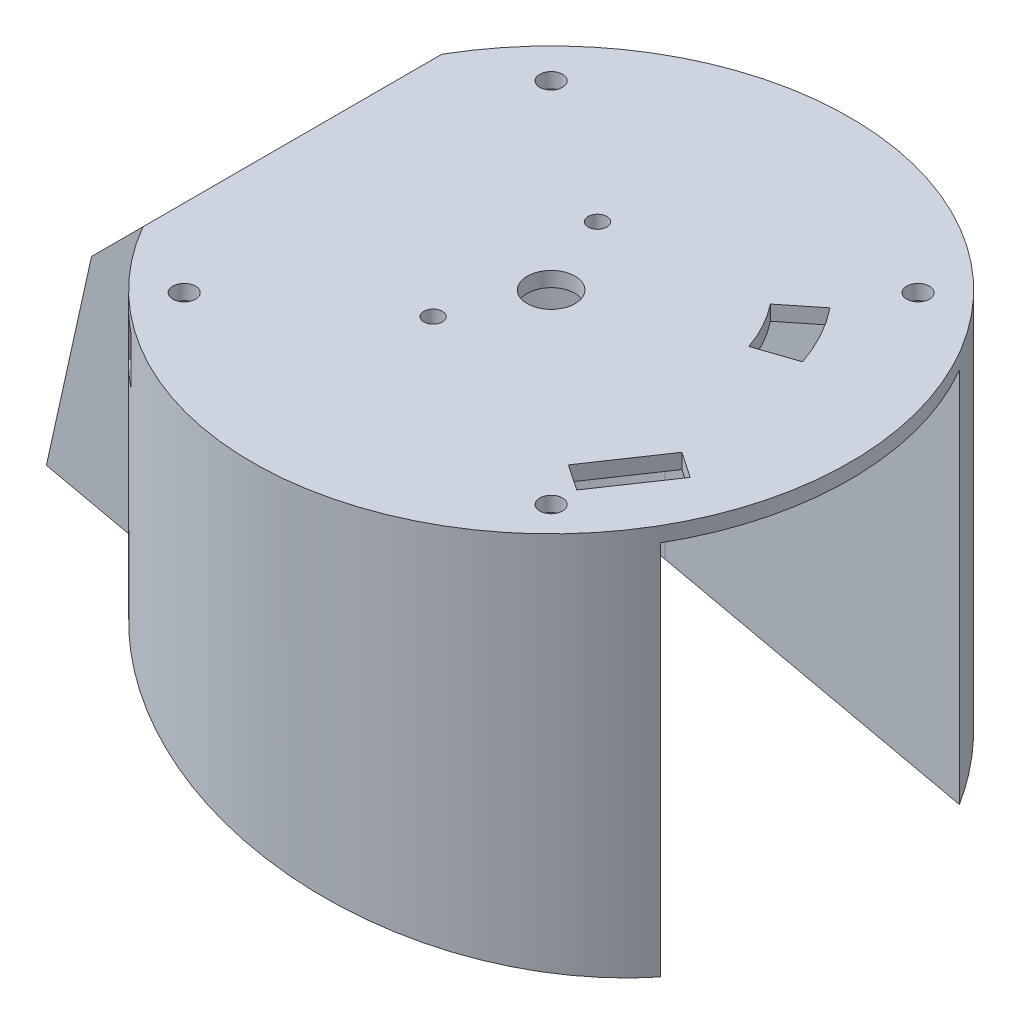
from build123d import *
from build123d.topology import SkipClean

# Parameters (mm, degrees)
SKETCH1_R           = 63.5
SKETCH1_R_2         = 5.08
SKETCH1_R_3         = 1.9685
BOSS_EXTRUDE1_DEPTH = 3.175
CUT_EXTRUDE5_REACH  = 91.859
SKETCH5_R           = 2.413
CUT_EXTRUDE4_REACH  = 91.859
BOSS_EXTRUDE2_START = 81.788
SKETCH6_R           = 2.413
BOSS_EXTRUDE2_DEPTH = 81.788
CUT_EXTRUDE9_DEPTH  = 208.229496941
CUT_EXTRUDE10_DEPTH = 12.7
CUT_EXTRUDE11_START = 10.16
CUT_EXTRUDE11_DEPTH = 10.16
BOSS_EXTRUDE3_REACH = 123.126
SKETCH12_W          = 24.686881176
SKETCH12_H          = 63.5
CHAMFER1_SIZE       = 8.509
CHAMFER1_SIZE2      = 11.198168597
SKETCH14_W          = 38.44773649
SKETCH14_H          = 44.263038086
CUT_EXTRUDE12_DEPTH = 169.278958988


with BuildPart() as part:
    # Sketch1 → Boss-Extrude1 (new body)
    with BuildSketch(Plane(origin=(0, 0, 0), x_dir=(1, 0, 0), z_dir=(0, 1, 0))):
        with Locations(Location((0, 0, 0), (0, 0, 270))):
            Circle(SKETCH1_R)
        with Locations(Location((0, 0, 0), (0, 0, 270))):
            Circle(SKETCH1_R_2, mode=Mode.SUBTRACT)
        with Locations(Location((-7.62, -17.4625, 0), (0, 0, 270))):
            Circle(SKETCH1_R_3, mode=Mode.SUBTRACT)
        with Locations(Location((-7.62, 17.4625, 0), (0, 0, 270))):
            Circle(SKETCH1_R_3, mode=Mode.SUBTRACT)
    extrude(amount=BOSS_EXTRUDE1_DEPTH)

    # Sketch5 → Cut-Extrude5 (cut, up to next)
    with BuildSketch(Plane.XZ, mode=Mode.PRIVATE) as cut_extrude5_sk1:
        with Locations(Location((39.497, -38.481, 0), (0, 0, 270))):
            Circle(SKETCH5_R)
    cut_extrude5_tool1 = extrude(cut_extrude5_sk1.sketch, amount=-CUT_EXTRUDE5_REACH, mode=Mode.PRIVATE) & part.part
    # Sketch5 → Cut-Extrude5 (cut, up to next)
    with BuildSketch(Plane.XZ, mode=Mode.PRIVATE) as cut_extrude5_sk2:
        with Locations(Location((-38.481, -38.481, 0), (0, 0, 270))):
            Circle(SKETCH5_R)
    cut_extrude5_tool2 = extrude(cut_extrude5_sk2.sketch, amount=-CUT_EXTRUDE5_REACH, mode=Mode.PRIVATE) & part.part
    # Sketch5 → Cut-Extrude5 (cut, up to next)
    with BuildSketch(Plane.XZ, mode=Mode.PRIVATE) as cut_extrude5_sk3:
        with Locations(Location((-38.481, 39.497, 0), (0, 0, 270))):
            Circle(SKETCH5_R)
    cut_extrude5_tool3 = extrude(cut_extrude5_sk3.sketch, amount=-CUT_EXTRUDE5_REACH, mode=Mode.PRIVATE) & part.part
    # Sketch5 → Cut-Extrude5 (cut, up to next)
    with BuildSketch(Plane.XZ, mode=Mode.PRIVATE) as cut_extrude5_sk4:
        with Locations(Location((39.497, 39.497, 0), (0, 0, 270))):
            Circle(SKETCH5_R)
    cut_extrude5_tool4 = extrude(cut_extrude5_sk4.sketch, amount=-CUT_EXTRUDE5_REACH, mode=Mode.PRIVATE) & part.part
    add(cut_extrude5_tool1.solids().sort_by_distance((39.497, 0, -38.481))[0], mode=Mode.SUBTRACT)
    add(cut_extrude5_tool2.solids().sort_by_distance((-38.481, 0, -38.481))[0], mode=Mode.SUBTRACT)
    add(cut_extrude5_tool3.solids().sort_by_distance((-38.481, 0, 39.497))[0], mode=Mode.SUBTRACT)
    add(cut_extrude5_tool4.solids().sort_by_distance((39.497, 0, 39.497))[0], mode=Mode.SUBTRACT)

    # Sketch4 → Cut-Extrude4 (cut, up to next)
    with BuildSketch(Plane.XZ, mode=Mode.PRIVATE) as cut_extrude4_sk1:
        with BuildLine():
            Line((32.932534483, -26.329661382), (25.889733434, -20.698920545))
            ThreePointArc((25.889733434, -20.698920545), (29.090740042, -15.8887524), (31.407839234, -10.595812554))
            Line((31.407839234, -10.595812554), (39.951734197, -13.478198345))
            ThreePointArc((39.951734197, -13.478198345), (37.004313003, -20.210980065), (32.932534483, -26.329661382))
        make_face()
    cut_extrude4_tool1 = extrude(cut_extrude4_sk1.sketch, amount=-CUT_EXTRUDE4_REACH, mode=Mode.PRIVATE) & part.part
    add(cut_extrude4_tool1.solids().sort_by_distance((33.037116, 0, -18.04418))[0], mode=Mode.SUBTRACT)

    # Sketch6 → Boss-Extrude2 (add)
    with SkipClean():  # the faces are left unmerged after this step: merging them gives an invalid solid
        with BuildSketch(Plane.XZ.offset(BOSS_EXTRUDE2_START)):
            with BuildLine():
                ThreePointArc((-7.533524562, -31.75), (-39.283524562, 0), (-7.533524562, 31.75))
                Line((-7.533524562, 31.75), (54.99261314, 31.75))
                ThreePointArc((54.99261314, 31.75), (-63.5, 0), (54.99261314, -31.75))
                Line((54.99261314, -31.75), (-7.533524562, -31.75))
            make_face()
            with Locations(Location((-38.481, -38.481, 0), (0, 0, 270))):
                Circle(SKETCH6_R, mode=Mode.SUBTRACT)
            with Locations(Location((39.497, -38.481, 0), (0, 0, 270))):
                Circle(SKETCH6_R, mode=Mode.SUBTRACT)
            with Locations(Location((-38.481, 39.497, 0), (0, 0, 270))):
                Circle(SKETCH6_R, mode=Mode.SUBTRACT)
            with Locations(Location((39.497, 39.497, 0), (0, 0, 270))):
                Circle(SKETCH6_R, mode=Mode.SUBTRACT)
        extrude(amount=-BOSS_EXTRUDE2_DEPTH)

    # Sketch8 → Cut-Extrude9 (cut, through all)
    with SkipClean():  # the faces are left unmerged after this step: merging them gives an invalid solid
        with BuildSketch(Plane(origin=(-77.995316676, -26.565930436, -77.473979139), x_dir=(1, 0, 0), z_dir=(0, 0, 1))):
            Polygon((141.495316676, -55.222069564), (14.495316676, -55.222069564), (14.495316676, -27.066847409), align=None)
        extrude(amount=CUT_EXTRUDE9_DEPTH, mode=Mode.SUBTRACT)

    # Sketch10 → Cut-Extrude10 (cut)
    with SkipClean():  # the faces are left unmerged after this step: merging them gives an invalid solid
        with BuildSketch(Plane(origin=(0, 3.175, 0), x_dir=(1, 0, 0), z_dir=(0, 1, 0))):
            Polygon((34.035487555, -30.372300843), (39.54214831, -34.101232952), (49.280353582, -19.720442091), (43.773692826, -15.991509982), align=None)
        extrude(amount=-CUT_EXTRUDE10_DEPTH, mode=Mode.SUBTRACT)

    # Sketch11 → Cut-Extrude11 (cut)
    with BuildSketch(Plane.XZ.offset(CUT_EXTRUDE11_START)):
        Polygon((43.749762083, 31.75), (43.749762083, 39.497), (41.623381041, 35.814), (37.370618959, 35.814), (35.244237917, 39.497), (35.244237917, 31.75), (36.069990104, 31.75), (41.134327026, 31.75), align=None)
        Polygon((37.370618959, 35.814), (41.623381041, 35.814), (43.749762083, 39.497), (41.623381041, 43.18), (37.370618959, 43.18), (35.244237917, 39.497), align=None)
        Polygon((41.623381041, -34.798), (37.370618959, -34.798), (35.244237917, -38.481), (37.370618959, -42.164), (41.623381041, -42.164), (43.749762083, -38.481), align=None)
        Polygon((35.244237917, -31.75), (35.244237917, -38.481), (37.370618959, -34.798), (41.623381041, -34.798), (43.749762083, -38.481), (43.749762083, -31.75), align=None)
        Polygon((-40.607381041, -42.164), (-36.354618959, -42.164), (-34.228237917, -38.481), (-36.354618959, -34.798), (-40.607381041, -34.798), (-42.733762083, -38.481), align=None)
        with BuildLine():
            ThreePointArc((-40.329527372, -49.048743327), (-43.175878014, -46.562791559), (-45.869305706, -43.911920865))
            Line((-45.869305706, -43.911920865), (-42.733762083, -38.481))
            Line((-42.733762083, -38.481), (-40.607381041, -42.164))
            Line((-40.607381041, -42.164), (-36.354618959, -42.164))
            Line((-36.354618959, -42.164), (-40.329527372, -49.048743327))
        make_face()
        Polygon((-40.607381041, 35.814), (-36.354618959, 35.814), (-34.228237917, 39.497), (-36.354618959, 43.18), (-40.607381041, 43.18), (-42.733762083, 39.497), align=None)
        with BuildLine():
            Line((-36.354618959, 43.18), (-39.930707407, 49.373966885))
            ThreePointArc((-39.930707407, 49.373966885), (-42.791981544, 46.915842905), (-45.502248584, 44.292159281))
            Line((-45.502248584, 44.292159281), (-42.733762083, 39.497))
            Line((-42.733762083, 39.497), (-40.607381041, 43.18))
            Line((-40.607381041, 43.18), (-36.354618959, 43.18))
        make_face()
    extrude(amount=-CUT_EXTRUDE11_DEPTH, mode=Mode.SUBTRACT)

    # Boss-Extrude3: up to this plane
    boss_extrude3_end = Plane(origin=(0, 3.175, 0), z_dir=(0, 1, 0))
    # Sketch12 → Boss-Extrude3 (add, up to the surface)
    with BuildSketch(Plane(origin=(-14.307823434, -64.538420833, 0), x_dir=(0.9762960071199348, -0.2164396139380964, 0), z_dir=(-0.2164396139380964, -0.9762960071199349, 0)), mode=Mode.PRIVATE) as boss_extrude3_sk1:
        with Locations((-50.338551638, 0)):
            Rectangle(SKETCH12_W, SKETCH12_H)
    boss_extrude3_tool1 = split(extrude(boss_extrude3_sk1.sketch, amount=-BOSS_EXTRUDE3_REACH, mode=Mode.PRIVATE), bisect_by=boss_extrude3_end, keep=Keep.BOTH, mode=Mode.PRIVATE)
    add(boss_extrude3_tool1.solids().sort_by_distance((-63.45315, -53.643164, 0))[0])

    # Chamfer1
    chamfer1_edges = [part.edges().sort_by_distance(p)[0] for p in [
        (-63.5, 3.175, 0),
    ]]
    chamfer1_side = [part.faces().sort_by_distance(p)[0] for p in [
        (-30.851974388, 3.175, 53.437187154),
    ]]
    chamfer(chamfer1_edges, length=CHAMFER1_SIZE, length2=CHAMFER1_SIZE2, reference=chamfer1_side[0])

    # Sketch14 → Cut-Extrude12 (cut, through all)
    with BuildSketch(Plane(origin=(-61.196178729, 13.566866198, 0), x_dir=(0, 0, 1), z_dir=(-0.9762960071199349, 0.21643961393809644, 0))):
        with Locations((0, -43.973863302)):
            Rectangle(SKETCH14_W, SKETCH14_H)
    extrude(amount=-CUT_EXTRUDE12_DEPTH, mode=Mode.SUBTRACT)


solid = part.part
